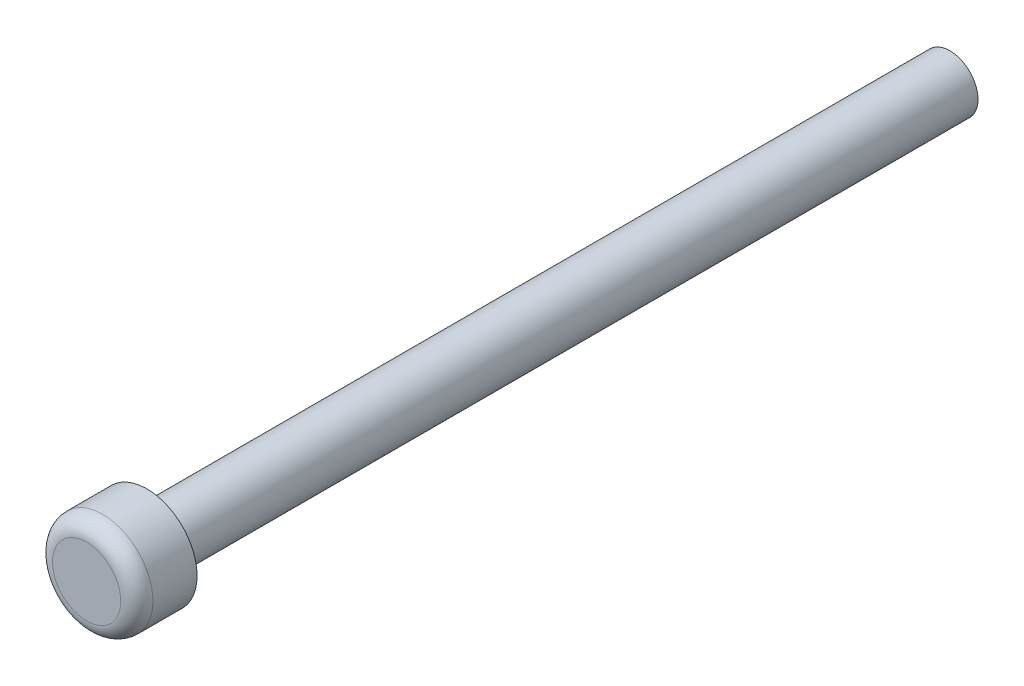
from build123d import *

# Parameters (mm, degrees)
BOSS_EXTRUDE1_DEPTH      = 80
BOSS_EXTRUDE1_DEPTH_BACK = 120
SKETCH1_R                = 7
SKETCH2_R                = 12.5
BOSS_EXTRUDE2_DEPTH      = 15
FILLET1_R                = 4


with BuildPart() as part:
    # Sketch1 → Boss-Extrude1 (new, two sides: drawn at the far end of the back side and taken through both)
    with BuildSketch(Plane.XY.offset(-BOSS_EXTRUDE1_DEPTH_BACK)):
        with Locations((212.5, 139)):
            Circle(SKETCH1_R)
    extrude(amount=BOSS_EXTRUDE1_DEPTH + BOSS_EXTRUDE1_DEPTH_BACK)

    # Sketch2 → Boss-Extrude2 (add)
    with BuildSketch(Plane.XY.offset(80)):
        with Locations((212.5, 139)):
            Circle(SKETCH2_R)
    extrude(amount=BOSS_EXTRUDE2_DEPTH)

    # Fillet1
    fillet1_edges = [part.edges().sort_by_distance(p)[0] for p in [
        (200, 139, 95),
    ]]
    fillet(fillet1_edges, radius=FILLET1_R)


solid = part.part
